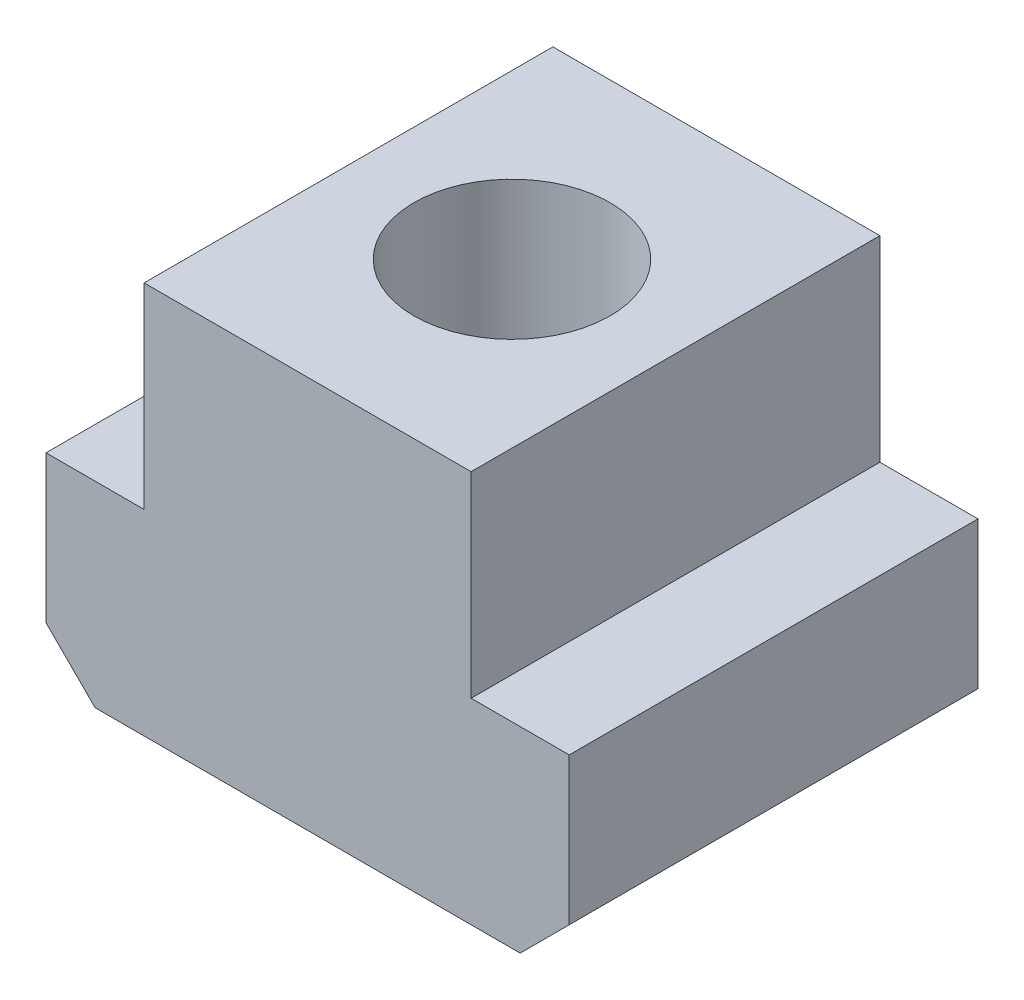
ISO-10303-21;
HEADER;
FILE_DESCRIPTION(('STEP AP214'),'2;1');
FILE_NAME('part.step','',(''),(''),'','','');
FILE_SCHEMA(('AUTOMOTIVE_DESIGN { 1 0 10303 214 1 1 1 1 }'));
ENDSEC;
DATA;
#1=APPLICATION_CONTEXT('core data for automotive mechanical design processes');
#2=APPLICATION_PROTOCOL_DEFINITION('international standard','automotive_design',2000,#1);
#3=PRODUCT_CONTEXT('',#1,'mechanical');
#4=PRODUCT('Part','Part','',(#3));
#5=PRODUCT_RELATED_PRODUCT_CATEGORY('part','',(#4));
#6=PRODUCT_DEFINITION_FORMATION('','',#4);
#7=PRODUCT_DEFINITION_CONTEXT('part definition',#1,'design');
#8=PRODUCT_DEFINITION('design','',#6,#7);
#9=PRODUCT_DEFINITION_SHAPE('','',#8);
#10=(LENGTH_UNIT() NAMED_UNIT(*) SI_UNIT(.MILLI.,.METRE.));
#11=(NAMED_UNIT(*) PLANE_ANGLE_UNIT() SI_UNIT($,.RADIAN.));
#12=(NAMED_UNIT(*) SI_UNIT($,.STERADIAN.) SOLID_ANGLE_UNIT());
#13=UNCERTAINTY_MEASURE_WITH_UNIT(LENGTH_MEASURE(1.E-05),#10,'distance_accuracy_value','');
#14=(GEOMETRIC_REPRESENTATION_CONTEXT(3) GLOBAL_UNCERTAINTY_ASSIGNED_CONTEXT((#13)) GLOBAL_UNIT_ASSIGNED_CONTEXT((#10,
#11,#12)) REPRESENTATION_CONTEXT('',''));
#15=CARTESIAN_POINT('',(0.,0.,0.));
#16=DIRECTION('',(0.,0.,1.));
#17=DIRECTION('',(1.,0.,0.));
#18=AXIS2_PLACEMENT_3D('',#15,#16,#17);
#19=CARTESIAN_POINT('',(-16.,12.,25.));
#20=DIRECTION('',(0.,-1.,0.));
#21=DIRECTION('',(0.,0.,-1.));
#22=AXIS2_PLACEMENT_3D('',#19,#20,#21);
#23=PLANE('',#22);
#24=CARTESIAN_POINT('',(0.,12.,12.5));
#25=DIRECTION('',(0.,1.,0.));
#26=DIRECTION('',(0.,0.,1.));
#27=AXIS2_PLACEMENT_3D('',#24,#25,#26);
#28=CIRCLE('',#27,6.);
#29=CARTESIAN_POINT('',(0.,12.,18.5));
#30=VERTEX_POINT('',#29);
#31=EDGE_CURVE('E121',#30,#30,#28,.T.);
#32=ORIENTED_EDGE('',*,*,#31,.F.);
#33=EDGE_LOOP('',(#32));
#34=FACE_BOUND('',#33,.T.);
#35=DIRECTION('',(-1.,0.,0.));
#36=VECTOR('',#35,1.);
#37=CARTESIAN_POINT('',(-16.,12.,0.));
#38=LINE('',#37,#36);
#39=CARTESIAN_POINT('',(-10.,12.,0.));
#40=VERTEX_POINT('',#39);
#41=CARTESIAN_POINT('',(10.,12.,0.));
#42=VERTEX_POINT('',#41);
#43=EDGE_CURVE('E109',#40,#42,#38,.F.);
#44=ORIENTED_EDGE('',*,*,#43,.F.);
#45=DIRECTION('',(0.,0.,-1.));
#46=VECTOR('',#45,1.);
#47=CARTESIAN_POINT('',(-10.,12.,25.));
#48=LINE('',#47,#46);
#49=CARTESIAN_POINT('',(-10.,12.,25.));
#50=VERTEX_POINT('',#49);
#51=EDGE_CURVE('E106',#50,#40,#48,.T.);
#52=ORIENTED_EDGE('',*,*,#51,.F.);
#53=DIRECTION('',(1.,0.,0.));
#54=VECTOR('',#53,1.);
#55=CARTESIAN_POINT('',(-16.,12.,25.));
#56=LINE('',#55,#54);
#57=CARTESIAN_POINT('',(10.,12.,25.));
#58=VERTEX_POINT('',#57);
#59=EDGE_CURVE('E25',#50,#58,#56,.T.);
#60=ORIENTED_EDGE('',*,*,#59,.T.);
#61=DIRECTION('',(0.,0.,1.));
#62=VECTOR('',#61,1.);
#63=CARTESIAN_POINT('',(10.,12.,0.));
#64=LINE('',#63,#62);
#65=EDGE_CURVE('E113',#42,#58,#64,.T.);
#66=ORIENTED_EDGE('',*,*,#65,.F.);
#67=EDGE_LOOP('',(#44,#52,#60,#66));
#68=FACE_BOUND('',#67,.T.);
#69=ADVANCED_FACE('F17',(#34,#68),#23,.F.);
#70=CARTESIAN_POINT('',(-16.,-12.,25.));
#71=DIRECTION('',(0.,1.,0.));
#72=DIRECTION('',(0.,0.,1.));
#73=AXIS2_PLACEMENT_3D('',#70,#71,#72);
#74=PLANE('',#73);
#75=CARTESIAN_POINT('',(0.,-12.,12.5));
#76=DIRECTION('',(0.,1.,0.));
#77=DIRECTION('',(0.,0.,1.));
#78=AXIS2_PLACEMENT_3D('',#75,#76,#77);
#79=CIRCLE('',#78,6.);
#80=CARTESIAN_POINT('',(0.,-12.,18.5));
#81=VERTEX_POINT('',#80);
#82=EDGE_CURVE('E122',#81,#81,#79,.T.);
#83=ORIENTED_EDGE('',*,*,#82,.T.);
#84=EDGE_LOOP('',(#83));
#85=FACE_BOUND('',#84,.T.);
#86=DIRECTION('',(0.,0.,1.));
#87=VECTOR('',#86,1.);
#88=CARTESIAN_POINT('',(13.,-12.,25.));
#89=LINE('',#88,#87);
#90=CARTESIAN_POINT('',(13.,-12.,0.));
#91=VERTEX_POINT('',#90);
#92=CARTESIAN_POINT('',(13.,-12.,25.));
#93=VERTEX_POINT('',#92);
#94=EDGE_CURVE('E134',#91,#93,#89,.T.);
#95=ORIENTED_EDGE('',*,*,#94,.T.);
#96=DIRECTION('',(1.,0.,0.));
#97=VECTOR('',#96,1.);
#98=CARTESIAN_POINT('',(-16.,-12.,25.));
#99=LINE('',#98,#97);
#100=CARTESIAN_POINT('',(-13.,-12.,25.));
#101=VERTEX_POINT('',#100);
#102=EDGE_CURVE('E170',#101,#93,#99,.T.);
#103=ORIENTED_EDGE('',*,*,#102,.F.);
#104=DIRECTION('',(0.,0.,1.));
#105=VECTOR('',#104,1.);
#106=CARTESIAN_POINT('',(-13.,-12.,25.));
#107=LINE('',#106,#105);
#108=CARTESIAN_POINT('',(-13.,-12.,0.));
#109=VERTEX_POINT('',#108);
#110=EDGE_CURVE('E142',#101,#109,#107,.F.);
#111=ORIENTED_EDGE('',*,*,#110,.T.);
#112=DIRECTION('',(-1.,0.,0.));
#113=VECTOR('',#112,1.);
#114=CARTESIAN_POINT('',(-16.,-12.,0.));
#115=LINE('',#114,#113);
#116=EDGE_CURVE('E11',#109,#91,#115,.F.);
#117=ORIENTED_EDGE('',*,*,#116,.T.);
#118=EDGE_LOOP('',(#95,#103,#111,#117));
#119=FACE_BOUND('',#118,.T.);
#120=ADVANCED_FACE('F202',(#85,#119),#74,.F.);
#121=CARTESIAN_POINT('',(-16.,-12.,0.));
#122=DIRECTION('',(0.,0.,1.));
#123=DIRECTION('',(1.,0.,0.));
#124=AXIS2_PLACEMENT_3D('',#121,#122,#123);
#125=PLANE('',#124);
#126=DIRECTION('',(0.,-1.,0.));
#127=VECTOR('',#126,1.);
#128=CARTESIAN_POINT('',(-10.,12.,0.));
#129=LINE('',#128,#127);
#130=CARTESIAN_POINT('',(-10.,0.,0.));
#131=VERTEX_POINT('',#130);
#132=EDGE_CURVE('E319',#40,#131,#129,.T.);
#133=ORIENTED_EDGE('',*,*,#132,.F.);
#134=ORIENTED_EDGE('',*,*,#43,.T.);
#135=DIRECTION('',(0.,1.,0.));
#136=VECTOR('',#135,1.);
#137=CARTESIAN_POINT('',(10.,0.,0.));
#138=LINE('',#137,#136);
#139=CARTESIAN_POINT('',(10.,0.,0.));
#140=VERTEX_POINT('',#139);
#141=EDGE_CURVE('E110',#140,#42,#138,.T.);
#142=ORIENTED_EDGE('',*,*,#141,.F.);
#143=DIRECTION('',(-1.,0.,0.));
#144=VECTOR('',#143,1.);
#145=CARTESIAN_POINT('',(16.,0.,0.));
#146=LINE('',#145,#144);
#147=CARTESIAN_POINT('',(16.,0.,0.));
#148=VERTEX_POINT('',#147);
#149=EDGE_CURVE('E165',#140,#148,#146,.F.);
#150=ORIENTED_EDGE('',*,*,#149,.T.);
#151=DIRECTION('',(0.,-1.,0.));
#152=VECTOR('',#151,1.);
#153=CARTESIAN_POINT('',(16.,-12.,0.));
#154=LINE('',#153,#152);
#155=CARTESIAN_POINT('',(16.,-9.,0.));
#156=VERTEX_POINT('',#155);
#157=EDGE_CURVE('E159',#156,#148,#154,.F.);
#158=ORIENTED_EDGE('',*,*,#157,.F.);
#159=DIRECTION('',(-0.707106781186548,-0.707106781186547,0.));
#160=VECTOR('',#159,1.);
#161=CARTESIAN_POINT('',(16.,-9.,0.));
#162=LINE('',#161,#160);
#163=EDGE_CURVE('E137',#156,#91,#162,.T.);
#164=ORIENTED_EDGE('',*,*,#163,.T.);
#165=ORIENTED_EDGE('',*,*,#116,.F.);
#166=DIRECTION('',(-0.707106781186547,0.707106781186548,0.));
#167=VECTOR('',#166,1.);
#168=CARTESIAN_POINT('',(-13.,-12.,0.));
#169=LINE('',#168,#167);
#170=CARTESIAN_POINT('',(-16.,-9.,0.));
#171=VERTEX_POINT('',#170);
#172=EDGE_CURVE('E125',#109,#171,#169,.T.);
#173=ORIENTED_EDGE('',*,*,#172,.T.);
#174=DIRECTION('',(0.,1.,0.));
#175=VECTOR('',#174,1.);
#176=CARTESIAN_POINT('',(-16.,-12.,0.));
#177=LINE('',#176,#175);
#178=CARTESIAN_POINT('',(-16.,0.,0.));
#179=VERTEX_POINT('',#178);
#180=EDGE_CURVE('E156',#179,#171,#177,.F.);
#181=ORIENTED_EDGE('',*,*,#180,.F.);
#182=DIRECTION('',(1.,0.,0.));
#183=VECTOR('',#182,1.);
#184=CARTESIAN_POINT('',(-16.,0.,0.));
#185=LINE('',#184,#183);
#186=EDGE_CURVE('E167',#131,#179,#185,.F.);
#187=ORIENTED_EDGE('',*,*,#186,.F.);
#188=EDGE_LOOP('',(#133,#134,#142,#150,#158,#164,#165,#173,#181,#187));
#189=FACE_BOUND('',#188,.T.);
#190=ADVANCED_FACE('F19',(#189),#125,.F.);
#191=CARTESIAN_POINT('',(16.,12.,25.));
#192=DIRECTION('',(-1.,0.,0.));
#193=DIRECTION('',(0.,-1.,0.));
#194=AXIS2_PLACEMENT_3D('',#191,#192,#193);
#195=PLANE('',#194);
#196=DIRECTION('',(0.,0.,-1.));
#197=VECTOR('',#196,1.);
#198=CARTESIAN_POINT('',(16.,0.,0.));
#199=LINE('',#198,#197);
#200=CARTESIAN_POINT('',(16.,0.,25.));
#201=VERTEX_POINT('',#200);
#202=EDGE_CURVE('E150',#148,#201,#199,.F.);
#203=ORIENTED_EDGE('',*,*,#202,.T.);
#204=DIRECTION('',(0.,1.,0.));
#205=VECTOR('',#204,1.);
#206=CARTESIAN_POINT('',(16.,12.,25.));
#207=LINE('',#206,#205);
#208=CARTESIAN_POINT('',(16.,-9.,25.));
#209=VERTEX_POINT('',#208);
#210=EDGE_CURVE('E153',#209,#201,#207,.T.);
#211=ORIENTED_EDGE('',*,*,#210,.F.);
#212=DIRECTION('',(0.,0.,1.));
#213=VECTOR('',#212,1.);
#214=CARTESIAN_POINT('',(16.,-9.,25.));
#215=LINE('',#214,#213);
#216=EDGE_CURVE('E139',#209,#156,#215,.F.);
#217=ORIENTED_EDGE('',*,*,#216,.T.);
#218=ORIENTED_EDGE('',*,*,#157,.T.);
#219=EDGE_LOOP('',(#203,#211,#217,#218));
#220=FACE_BOUND('',#219,.T.);
#221=ADVANCED_FACE('F181',(#220),#195,.F.);
#222=CARTESIAN_POINT('',(16.,0.,0.));
#223=DIRECTION('',(0.,-1.,0.));
#224=DIRECTION('',(1.,0.,0.));
#225=AXIS2_PLACEMENT_3D('',#222,#223,#224);
#226=PLANE('',#225);
#227=ORIENTED_EDGE('',*,*,#149,.F.);
#228=DIRECTION('',(0.,0.,-1.));
#229=VECTOR('',#228,1.);
#230=CARTESIAN_POINT('',(10.,0.,25.));
#231=LINE('',#230,#229);
#232=CARTESIAN_POINT('',(10.,0.,25.));
#233=VERTEX_POINT('',#232);
#234=EDGE_CURVE('E119',#233,#140,#231,.T.);
#235=ORIENTED_EDGE('',*,*,#234,.F.);
#236=DIRECTION('',(1.,0.,0.));
#237=VECTOR('',#236,1.);
#238=CARTESIAN_POINT('',(-16.,0.,25.));
#239=LINE('',#238,#237);
#240=EDGE_CURVE('E101',#233,#201,#239,.T.);
#241=ORIENTED_EDGE('',*,*,#240,.T.);
#242=ORIENTED_EDGE('',*,*,#202,.F.);
#243=EDGE_LOOP('',(#227,#235,#241,#242));
#244=FACE_BOUND('',#243,.T.);
#245=ADVANCED_FACE('F178',(#244),#226,.F.);
#246=CARTESIAN_POINT('',(-16.,0.,0.));
#247=DIRECTION('',(0.,-1.,0.));
#248=DIRECTION('',(0.,0.,-1.));
#249=AXIS2_PLACEMENT_3D('',#246,#247,#248);
#250=PLANE('',#249);
#251=DIRECTION('',(-1.,0.,0.));
#252=VECTOR('',#251,1.);
#253=CARTESIAN_POINT('',(-16.,0.,25.));
#254=LINE('',#253,#252);
#255=CARTESIAN_POINT('',(-10.,0.,25.));
#256=VERTEX_POINT('',#255);
#257=CARTESIAN_POINT('',(-16.,0.,25.));
#258=VERTEX_POINT('',#257);
#259=EDGE_CURVE('E37',#256,#258,#254,.T.);
#260=ORIENTED_EDGE('',*,*,#259,.F.);
#261=DIRECTION('',(0.,0.,1.));
#262=VECTOR('',#261,1.);
#263=CARTESIAN_POINT('',(-10.,0.,0.));
#264=LINE('',#263,#262);
#265=EDGE_CURVE('E32',#131,#256,#264,.T.);
#266=ORIENTED_EDGE('',*,*,#265,.F.);
#267=ORIENTED_EDGE('',*,*,#186,.T.);
#268=DIRECTION('',(0.,0.,-1.));
#269=VECTOR('',#268,1.);
#270=CARTESIAN_POINT('',(-16.,0.,25.));
#271=LINE('',#270,#269);
#272=EDGE_CURVE('E131',#179,#258,#271,.F.);
#273=ORIENTED_EDGE('',*,*,#272,.T.);
#274=EDGE_LOOP('',(#260,#266,#267,#273));
#275=FACE_BOUND('',#274,.T.);
#276=ADVANCED_FACE('F213',(#275),#250,.F.);
#277=CARTESIAN_POINT('',(-16.,12.,25.));
#278=DIRECTION('',(1.,0.,0.));
#279=DIRECTION('',(0.,0.,-1.));
#280=AXIS2_PLACEMENT_3D('',#277,#278,#279);
#281=PLANE('',#280);
#282=DIRECTION('',(0.,0.,1.));
#283=VECTOR('',#282,1.);
#284=CARTESIAN_POINT('',(-16.,-9.,25.));
#285=LINE('',#284,#283);
#286=CARTESIAN_POINT('',(-16.,-9.,25.));
#287=VERTEX_POINT('',#286);
#288=EDGE_CURVE('E145',#171,#287,#285,.T.);
#289=ORIENTED_EDGE('',*,*,#288,.T.);
#290=DIRECTION('',(0.,1.,0.));
#291=VECTOR('',#290,1.);
#292=CARTESIAN_POINT('',(-16.,-12.,25.));
#293=LINE('',#292,#291);
#294=EDGE_CURVE('E162',#287,#258,#293,.T.);
#295=ORIENTED_EDGE('',*,*,#294,.T.);
#296=ORIENTED_EDGE('',*,*,#272,.F.);
#297=ORIENTED_EDGE('',*,*,#180,.T.);
#298=EDGE_LOOP('',(#289,#295,#296,#297));
#299=FACE_BOUND('',#298,.T.);
#300=ADVANCED_FACE('F285',(#299),#281,.F.);
#301=CARTESIAN_POINT('',(-13.,-12.,25.));
#302=DIRECTION('',(0.707106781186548,0.707106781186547,0.));
#303=DIRECTION('',(-0.707106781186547,0.707106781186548,0.));
#304=AXIS2_PLACEMENT_3D('',#301,#302,#303);
#305=PLANE('',#304);
#306=ORIENTED_EDGE('',*,*,#110,.F.);
#307=DIRECTION('',(0.707106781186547,-0.707106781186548,0.));
#308=VECTOR('',#307,1.);
#309=CARTESIAN_POINT('',(-15.5,-9.5,25.));
#310=LINE('',#309,#308);
#311=EDGE_CURVE('E132',#287,#101,#310,.T.);
#312=ORIENTED_EDGE('',*,*,#311,.F.);
#313=ORIENTED_EDGE('',*,*,#288,.F.);
#314=ORIENTED_EDGE('',*,*,#172,.F.);
#315=EDGE_LOOP('',(#306,#312,#313,#314));
#316=FACE_BOUND('',#315,.T.);
#317=ADVANCED_FACE('F275',(#316),#305,.F.);
#318=CARTESIAN_POINT('',(16.,-9.,25.));
#319=DIRECTION('',(-0.707106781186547,0.707106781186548,0.));
#320=DIRECTION('',(-0.707106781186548,-0.707106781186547,0.));
#321=AXIS2_PLACEMENT_3D('',#318,#319,#320);
#322=PLANE('',#321);
#323=DIRECTION('',(0.707106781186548,0.707106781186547,0.));
#324=VECTOR('',#323,1.);
#325=CARTESIAN_POINT('',(13.5,-11.5,25.));
#326=LINE('',#325,#324);
#327=EDGE_CURVE('E128',#93,#209,#326,.T.);
#328=ORIENTED_EDGE('',*,*,#327,.F.);
#329=ORIENTED_EDGE('',*,*,#94,.F.);
#330=ORIENTED_EDGE('',*,*,#163,.F.);
#331=ORIENTED_EDGE('',*,*,#216,.F.);
#332=EDGE_LOOP('',(#328,#329,#330,#331));
#333=FACE_BOUND('',#332,.T.);
#334=ADVANCED_FACE('F264',(#333),#322,.F.);
#335=CARTESIAN_POINT('',(-16.,-12.,25.));
#336=DIRECTION('',(0.,0.,1.));
#337=DIRECTION('',(1.,0.,0.));
#338=AXIS2_PLACEMENT_3D('',#335,#336,#337);
#339=PLANE('',#338);
#340=DIRECTION('',(0.,1.,0.));
#341=VECTOR('',#340,1.);
#342=CARTESIAN_POINT('',(-10.,0.,25.));
#343=LINE('',#342,#341);
#344=EDGE_CURVE('E94',#256,#50,#343,.T.);
#345=ORIENTED_EDGE('',*,*,#344,.F.);
#346=ORIENTED_EDGE('',*,*,#259,.T.);
#347=ORIENTED_EDGE('',*,*,#294,.F.);
#348=ORIENTED_EDGE('',*,*,#311,.T.);
#349=ORIENTED_EDGE('',*,*,#102,.T.);
#350=ORIENTED_EDGE('',*,*,#327,.T.);
#351=ORIENTED_EDGE('',*,*,#210,.T.);
#352=ORIENTED_EDGE('',*,*,#240,.F.);
#353=DIRECTION('',(0.,-1.,0.));
#354=VECTOR('',#353,1.);
#355=CARTESIAN_POINT('',(10.,12.,25.));
#356=LINE('',#355,#354);
#357=EDGE_CURVE('E96',#58,#233,#356,.T.);
#358=ORIENTED_EDGE('',*,*,#357,.F.);
#359=ORIENTED_EDGE('',*,*,#59,.F.);
#360=EDGE_LOOP('',(#345,#346,#347,#348,#349,#350,#351,#352,#358,#359));
#361=FACE_BOUND('',#360,.T.);
#362=ADVANCED_FACE('F93',(#361),#339,.T.);
#363=CARTESIAN_POINT('',(0.,-12.,12.5));
#364=DIRECTION('',(0.,1.,0.));
#365=DIRECTION('',(0.,0.,1.));
#366=AXIS2_PLACEMENT_3D('',#363,#364,#365);
#367=CYLINDRICAL_SURFACE('',#366,6.);
#368=ORIENTED_EDGE('',*,*,#82,.F.);
#369=EDGE_LOOP('',(#368));
#370=FACE_BOUND('',#369,.T.);
#371=ORIENTED_EDGE('',*,*,#31,.T.);
#372=EDGE_LOOP('',(#371));
#373=FACE_BOUND('',#372,.T.);
#374=ADVANCED_FACE('F190',(#370,#373),#367,.F.);
#375=CARTESIAN_POINT('',(10.,0.,0.));
#376=DIRECTION('',(1.,0.,0.));
#377=DIRECTION('',(0.,1.,0.));
#378=AXIS2_PLACEMENT_3D('',#375,#376,#377);
#379=PLANE('',#378);
#380=ORIENTED_EDGE('',*,*,#141,.T.);
#381=ORIENTED_EDGE('',*,*,#65,.T.);
#382=ORIENTED_EDGE('',*,*,#357,.T.);
#383=ORIENTED_EDGE('',*,*,#234,.T.);
#384=EDGE_LOOP('',(#380,#381,#382,#383));
#385=FACE_BOUND('',#384,.T.);
#386=ADVANCED_FACE('F188',(#385),#379,.T.);
#387=CARTESIAN_POINT('',(-10.,0.,0.));
#388=DIRECTION('',(-1.,0.,0.));
#389=DIRECTION('',(0.,-1.,0.));
#390=AXIS2_PLACEMENT_3D('',#387,#388,#389);
#391=PLANE('',#390);
#392=ORIENTED_EDGE('',*,*,#132,.T.);
#393=ORIENTED_EDGE('',*,*,#265,.T.);
#394=ORIENTED_EDGE('',*,*,#344,.T.);
#395=ORIENTED_EDGE('',*,*,#51,.T.);
#396=EDGE_LOOP('',(#392,#393,#394,#395));
#397=FACE_BOUND('',#396,.T.);
#398=ADVANCED_FACE('F105',(#397),#391,.T.);
#399=CLOSED_SHELL('',(#69,#120,#190,#221,#245,#276,#300,#317,#334,#362,#374,#386,#398));
#400=MANIFOLD_SOLID_BREP('B1',#399);
#401=ADVANCED_BREP_SHAPE_REPRESENTATION('',(#18,#400),#14);
#402=SHAPE_DEFINITION_REPRESENTATION(#9,#401);
ENDSEC;
END-ISO-10303-21;
